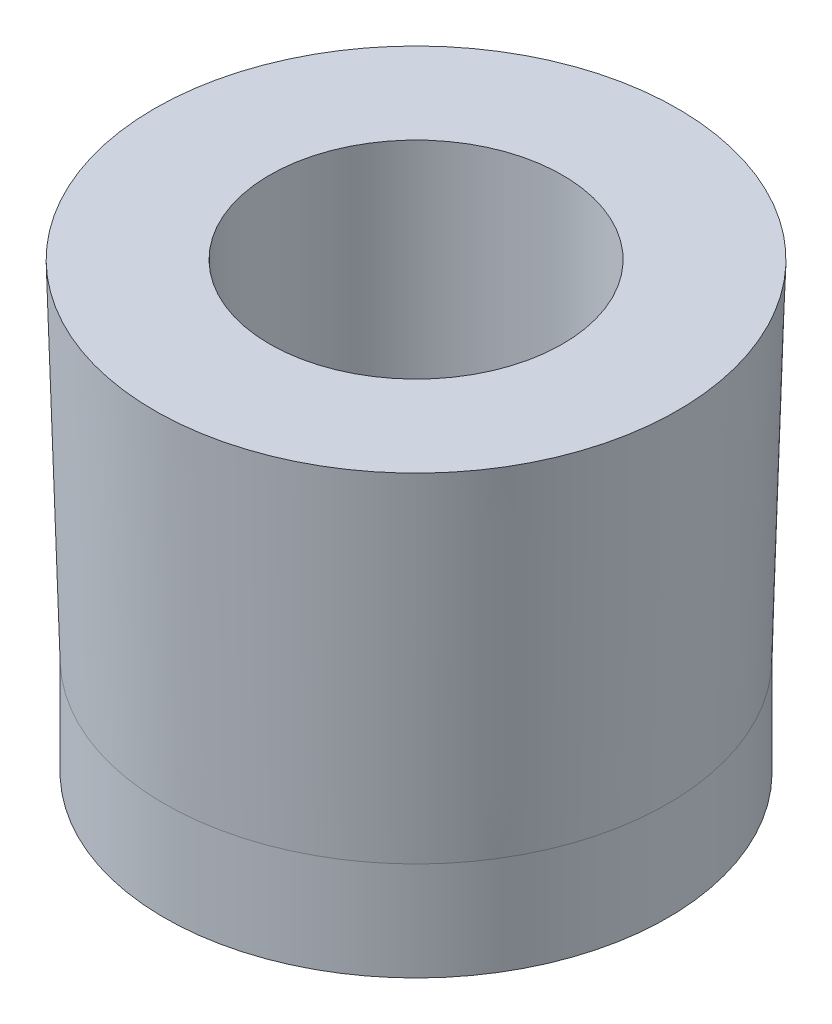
ISO-10303-21;
HEADER;
FILE_DESCRIPTION(('STEP AP214'),'2;1');
FILE_NAME('part.step','',(''),(''),'','','');
FILE_SCHEMA(('AUTOMOTIVE_DESIGN { 1 0 10303 214 1 1 1 1 }'));
ENDSEC;
DATA;
#1=APPLICATION_CONTEXT('core data for automotive mechanical design processes');
#2=APPLICATION_PROTOCOL_DEFINITION('international standard','automotive_design',2000,#1);
#3=PRODUCT_CONTEXT('',#1,'mechanical');
#4=PRODUCT('Part','Part','',(#3));
#5=PRODUCT_RELATED_PRODUCT_CATEGORY('part','',(#4));
#6=PRODUCT_DEFINITION_FORMATION('','',#4);
#7=PRODUCT_DEFINITION_CONTEXT('part definition',#1,'design');
#8=PRODUCT_DEFINITION('design','',#6,#7);
#9=PRODUCT_DEFINITION_SHAPE('','',#8);
#10=(LENGTH_UNIT() NAMED_UNIT(*) SI_UNIT(.MILLI.,.METRE.));
#11=(NAMED_UNIT(*) PLANE_ANGLE_UNIT() SI_UNIT($,.RADIAN.));
#12=(NAMED_UNIT(*) SI_UNIT($,.STERADIAN.) SOLID_ANGLE_UNIT());
#13=UNCERTAINTY_MEASURE_WITH_UNIT(LENGTH_MEASURE(1.E-05),#10,'distance_accuracy_value','');
#14=(GEOMETRIC_REPRESENTATION_CONTEXT(3) GLOBAL_UNCERTAINTY_ASSIGNED_CONTEXT((#13)) GLOBAL_UNIT_ASSIGNED_CONTEXT((#10,
#11,#12)) REPRESENTATION_CONTEXT('',''));
#15=CARTESIAN_POINT('',(0.,0.,0.));
#16=DIRECTION('',(0.,0.,1.));
#17=DIRECTION('',(1.,0.,0.));
#18=AXIS2_PLACEMENT_3D('',#15,#16,#17);
#19=CARTESIAN_POINT('',(1.9431,-4.31800000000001,0.));
#20=DIRECTION('',(0.,1.,0.));
#21=DIRECTION('',(-1.,0.,0.));
#22=AXIS2_PLACEMENT_3D('',#19,#20,#21);
#23=PLANE('',#22);
#24=CARTESIAN_POINT('',(0.,-4.31800000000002,0.));
#25=DIRECTION('',(0.,1.,0.));
#26=DIRECTION('',(0.,0.,1.));
#27=AXIS2_PLACEMENT_3D('',#24,#25,#26);
#28=CIRCLE('',#27,1.1303);
#29=CARTESIAN_POINT('',(0.,-4.31800000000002,1.1303));
#30=VERTEX_POINT('',#29);
#31=EDGE_CURVE('E42',#30,#30,#28,.T.);
#32=ORIENTED_EDGE('',*,*,#31,.T.);
#33=EDGE_LOOP('',(#32));
#34=FACE_BOUND('',#33,.T.);
#35=CARTESIAN_POINT('',(0.,-4.31799999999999,0.));
#36=DIRECTION('',(0.,1.,0.));
#37=DIRECTION('',(-1.,0.,0.));
#38=AXIS2_PLACEMENT_3D('',#35,#36,#37);
#39=CIRCLE('',#38,1.94310000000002);
#40=CARTESIAN_POINT('',(-1.94310000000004,-4.31799999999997,0.));
#41=VERTEX_POINT('',#40);
#42=EDGE_CURVE('E10',#41,#41,#39,.T.);
#43=ORIENTED_EDGE('',*,*,#42,.F.);
#44=EDGE_LOOP('',(#43));
#45=FACE_BOUND('',#44,.T.);
#46=ADVANCED_FACE('F28',(#34,#45),#23,.F.);
#47=CARTESIAN_POINT('',(0.,0.,0.));
#48=DIRECTION('',(0.,1.,0.));
#49=DIRECTION('',(-1.,0.,0.));
#50=AXIS2_PLACEMENT_3D('',#47,#48,#49);
#51=CYLINDRICAL_SURFACE('',#50,1.94310000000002);
#52=CARTESIAN_POINT('',(0.,-3.55599999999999,0.));
#53=DIRECTION('',(0.,1.,0.));
#54=DIRECTION('',(-1.,0.,0.));
#55=AXIS2_PLACEMENT_3D('',#52,#53,#54);
#56=CIRCLE('',#55,1.94310000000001);
#57=CARTESIAN_POINT('',(-1.94310000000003,-3.55599999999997,0.));
#58=VERTEX_POINT('',#57);
#59=EDGE_CURVE('E34',#58,#58,#56,.T.);
#60=ORIENTED_EDGE('',*,*,#59,.F.);
#61=EDGE_LOOP('',(#60));
#62=FACE_BOUND('',#61,.T.);
#63=ORIENTED_EDGE('',*,*,#42,.T.);
#64=EDGE_LOOP('',(#63));
#65=FACE_BOUND('',#64,.T.);
#66=ADVANCED_FACE('F61',(#62,#65),#51,.T.);
#67=CARTESIAN_POINT('',(0.,-3.55599999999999,0.));
#68=DIRECTION('',(0.,1.,0.));
#69=DIRECTION('',(-1.,0.,0.));
#70=AXIS2_PLACEMENT_3D('',#67,#68,#69);
#71=CONICAL_SURFACE('',#70,1.94310000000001,0.0285636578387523);
#72=CARTESIAN_POINT('',(0.,-0.888999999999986,0.));
#73=DIRECTION('',(0.,1.,0.));
#74=DIRECTION('',(-1.,0.,0.));
#75=AXIS2_PLACEMENT_3D('',#72,#73,#74);
#76=CIRCLE('',#75,2.01929999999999);
#77=CARTESIAN_POINT('',(-2.01929999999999,-0.888999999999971,0.));
#78=VERTEX_POINT('',#77);
#79=EDGE_CURVE('E38',#78,#78,#76,.T.);
#80=ORIENTED_EDGE('',*,*,#79,.F.);
#81=EDGE_LOOP('',(#80));
#82=FACE_BOUND('',#81,.T.);
#83=ORIENTED_EDGE('',*,*,#59,.T.);
#84=EDGE_LOOP('',(#83));
#85=FACE_BOUND('',#84,.T.);
#86=ADVANCED_FACE('F56',(#82,#85),#71,.T.);
#87=CARTESIAN_POINT('',(0.,-0.888999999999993,0.));
#88=DIRECTION('',(0.,-1.,0.));
#89=DIRECTION('',(1.,0.,0.));
#90=AXIS2_PLACEMENT_3D('',#87,#88,#89);
#91=PLANE('',#90);
#92=CARTESIAN_POINT('',(0.,-0.888999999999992,0.));
#93=DIRECTION('',(0.,1.,0.));
#94=DIRECTION('',(0.,0.,1.));
#95=AXIS2_PLACEMENT_3D('',#92,#93,#94);
#96=CIRCLE('',#95,1.13029999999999);
#97=CARTESIAN_POINT('',(0.,-0.888999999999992,1.13029999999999));
#98=VERTEX_POINT('',#97);
#99=EDGE_CURVE('E47',#98,#98,#96,.T.);
#100=ORIENTED_EDGE('',*,*,#99,.F.);
#101=EDGE_LOOP('',(#100));
#102=FACE_BOUND('',#101,.T.);
#103=ORIENTED_EDGE('',*,*,#79,.T.);
#104=EDGE_LOOP('',(#103));
#105=FACE_BOUND('',#104,.T.);
#106=ADVANCED_FACE('F53',(#102,#105),#91,.F.);
#107=CARTESIAN_POINT('',(0.,-0.888999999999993,0.));
#108=DIRECTION('',(0.,1.,0.));
#109=DIRECTION('',(0.,0.,1.));
#110=AXIS2_PLACEMENT_3D('',#107,#108,#109);
#111=CYLINDRICAL_SURFACE('',#110,1.13029999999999);
#112=ORIENTED_EDGE('',*,*,#31,.F.);
#113=EDGE_LOOP('',(#112));
#114=FACE_BOUND('',#113,.T.);
#115=ORIENTED_EDGE('',*,*,#99,.T.);
#116=EDGE_LOOP('',(#115));
#117=FACE_BOUND('',#116,.T.);
#118=ADVANCED_FACE('F51',(#114,#117),#111,.F.);
#119=CLOSED_SHELL('',(#46,#66,#86,#106,#118));
#120=MANIFOLD_SOLID_BREP('B2',#119);
#121=ADVANCED_BREP_SHAPE_REPRESENTATION('',(#18,#120),#14);
#122=SHAPE_DEFINITION_REPRESENTATION(#9,#121);
ENDSEC;
END-ISO-10303-21;
